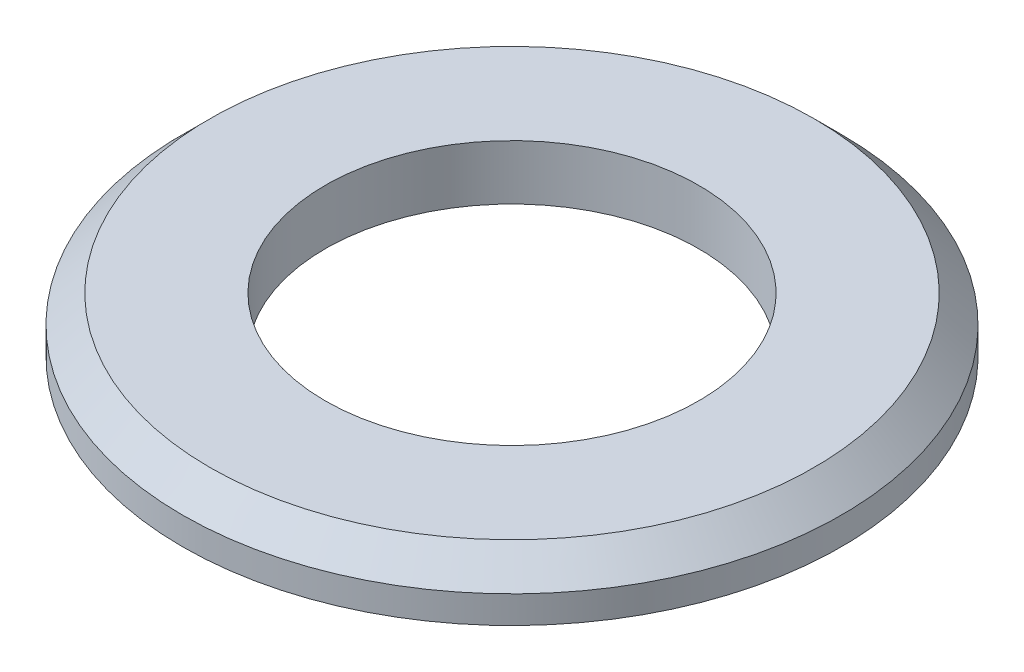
ISO-10303-21;
HEADER;
FILE_DESCRIPTION(('STEP AP214'),'2;1');
FILE_NAME('part.step','',(''),(''),'','','');
FILE_SCHEMA(('AUTOMOTIVE_DESIGN { 1 0 10303 214 1 1 1 1 }'));
ENDSEC;
DATA;
#1=APPLICATION_CONTEXT('core data for automotive mechanical design processes');
#2=APPLICATION_PROTOCOL_DEFINITION('international standard','automotive_design',2000,#1);
#3=PRODUCT_CONTEXT('',#1,'mechanical');
#4=PRODUCT('Part','Part','',(#3));
#5=PRODUCT_RELATED_PRODUCT_CATEGORY('part','',(#4));
#6=PRODUCT_DEFINITION_FORMATION('','',#4);
#7=PRODUCT_DEFINITION_CONTEXT('part definition',#1,'design');
#8=PRODUCT_DEFINITION('design','',#6,#7);
#9=PRODUCT_DEFINITION_SHAPE('','',#8);
#10=(LENGTH_UNIT() NAMED_UNIT(*) SI_UNIT(.MILLI.,.METRE.));
#11=(NAMED_UNIT(*) PLANE_ANGLE_UNIT() SI_UNIT($,.RADIAN.));
#12=(NAMED_UNIT(*) SI_UNIT($,.STERADIAN.) SOLID_ANGLE_UNIT());
#13=UNCERTAINTY_MEASURE_WITH_UNIT(LENGTH_MEASURE(1.E-05),#10,'distance_accuracy_value','');
#14=(GEOMETRIC_REPRESENTATION_CONTEXT(3) GLOBAL_UNCERTAINTY_ASSIGNED_CONTEXT((#13)) GLOBAL_UNIT_ASSIGNED_CONTEXT((#10,
#11,#12)) REPRESENTATION_CONTEXT('',''));
#15=CARTESIAN_POINT('',(0.,0.,0.));
#16=DIRECTION('',(0.,0.,1.));
#17=DIRECTION('',(1.,0.,0.));
#18=AXIS2_PLACEMENT_3D('',#15,#16,#17);
#19=CARTESIAN_POINT('',(0.,5.,0.));
#20=DIRECTION('',(0.,1.,0.));
#21=DIRECTION('',(0.,0.,1.));
#22=AXIS2_PLACEMENT_3D('',#19,#20,#21);
#23=PLANE('',#22);
#24=CARTESIAN_POINT('',(0.,5.,0.));
#25=DIRECTION('',(0.,1.,0.));
#26=DIRECTION('',(0.,0.,1.));
#27=AXIS2_PLACEMENT_3D('',#24,#25,#26);
#28=CIRCLE('',#27,27.5);
#29=CARTESIAN_POINT('',(0.,5.,27.5));
#30=VERTEX_POINT('',#29);
#31=EDGE_CURVE('E35',#30,#30,#28,.T.);
#32=ORIENTED_EDGE('',*,*,#31,.T.);
#33=EDGE_LOOP('',(#32));
#34=FACE_BOUND('',#33,.T.);
#35=CARTESIAN_POINT('',(0.,5.,0.));
#36=DIRECTION('',(0.,1.,0.));
#37=DIRECTION('',(0.,0.,1.));
#38=AXIS2_PLACEMENT_3D('',#35,#36,#37);
#39=CIRCLE('',#38,17.);
#40=CARTESIAN_POINT('',(0.,5.,17.));
#41=VERTEX_POINT('',#40);
#42=EDGE_CURVE('E43',#41,#41,#39,.T.);
#43=ORIENTED_EDGE('',*,*,#42,.F.);
#44=EDGE_LOOP('',(#43));
#45=FACE_BOUND('',#44,.T.);
#46=ADVANCED_FACE('F28',(#34,#45),#23,.T.);
#47=CARTESIAN_POINT('',(0.,0.,0.));
#48=DIRECTION('',(0.,1.,0.));
#49=DIRECTION('',(0.,0.,1.));
#50=AXIS2_PLACEMENT_3D('',#47,#48,#49);
#51=PLANE('',#50);
#52=CARTESIAN_POINT('',(0.,0.,0.));
#53=DIRECTION('',(0.,1.,0.));
#54=DIRECTION('',(0.,0.,1.));
#55=AXIS2_PLACEMENT_3D('',#52,#53,#54);
#56=CIRCLE('',#55,30.);
#57=CARTESIAN_POINT('',(0.,0.,30.));
#58=VERTEX_POINT('',#57);
#59=EDGE_CURVE('E39',#58,#58,#56,.T.);
#60=ORIENTED_EDGE('',*,*,#59,.F.);
#61=EDGE_LOOP('',(#60));
#62=FACE_BOUND('',#61,.T.);
#63=CARTESIAN_POINT('',(0.,0.,0.));
#64=DIRECTION('',(0.,1.,0.));
#65=DIRECTION('',(0.,0.,1.));
#66=AXIS2_PLACEMENT_3D('',#63,#64,#65);
#67=CIRCLE('',#66,17.);
#68=CARTESIAN_POINT('',(0.,0.,17.));
#69=VERTEX_POINT('',#68);
#70=EDGE_CURVE('E48',#69,#69,#67,.T.);
#71=ORIENTED_EDGE('',*,*,#70,.T.);
#72=EDGE_LOOP('',(#71));
#73=FACE_BOUND('',#72,.T.);
#74=ADVANCED_FACE('F52',(#62,#73),#51,.F.);
#75=CARTESIAN_POINT('',(0.,5.,0.));
#76=DIRECTION('',(0.,-1.,0.));
#77=DIRECTION('',(0.,0.,-1.));
#78=AXIS2_PLACEMENT_3D('',#75,#76,#77);
#79=CYLINDRICAL_SURFACE('',#78,30.);
#80=CARTESIAN_POINT('',(0.,2.49999999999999,0.));
#81=DIRECTION('',(0.,1.,0.));
#82=DIRECTION('',(0.,0.,1.));
#83=AXIS2_PLACEMENT_3D('',#80,#81,#82);
#84=CIRCLE('',#83,30.);
#85=CARTESIAN_POINT('',(0.,2.49999999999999,30.));
#86=VERTEX_POINT('',#85);
#87=EDGE_CURVE('E10',#86,#86,#84,.F.);
#88=ORIENTED_EDGE('',*,*,#87,.T.);
#89=EDGE_LOOP('',(#88));
#90=FACE_BOUND('',#89,.T.);
#91=ORIENTED_EDGE('',*,*,#59,.T.);
#92=EDGE_LOOP('',(#91));
#93=FACE_BOUND('',#92,.T.);
#94=ADVANCED_FACE('F30',(#90,#93),#79,.T.);
#95=CARTESIAN_POINT('',(0.,5.,0.));
#96=DIRECTION('',(0.,-1.,0.));
#97=DIRECTION('',(0.,0.,-1.));
#98=AXIS2_PLACEMENT_3D('',#95,#96,#97);
#99=CYLINDRICAL_SURFACE('',#98,17.);
#100=ORIENTED_EDGE('',*,*,#42,.T.);
#101=EDGE_LOOP('',(#100));
#102=FACE_BOUND('',#101,.T.);
#103=ORIENTED_EDGE('',*,*,#70,.F.);
#104=EDGE_LOOP('',(#103));
#105=FACE_BOUND('',#104,.T.);
#106=ADVANCED_FACE('F54',(#102,#105),#99,.F.);
#107=CARTESIAN_POINT('',(0.,5.,0.));
#108=DIRECTION('',(0.,-1.,0.));
#109=DIRECTION('',(0.,0.,-1.));
#110=AXIS2_PLACEMENT_3D('',#107,#108,#109);
#111=CONICAL_SURFACE('',#110,27.5,0.785398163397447);
#112=ORIENTED_EDGE('',*,*,#87,.F.);
#113=EDGE_LOOP('',(#112));
#114=FACE_BOUND('',#113,.T.);
#115=ORIENTED_EDGE('',*,*,#31,.F.);
#116=EDGE_LOOP('',(#115));
#117=FACE_BOUND('',#116,.T.);
#118=ADVANCED_FACE('F56',(#114,#117),#111,.T.);
#119=CLOSED_SHELL('',(#46,#74,#94,#106,#118));
#120=MANIFOLD_SOLID_BREP('B2',#119);
#121=ADVANCED_BREP_SHAPE_REPRESENTATION('',(#18,#120),#14);
#122=SHAPE_DEFINITION_REPRESENTATION(#9,#121);
ENDSEC;
END-ISO-10303-21;
